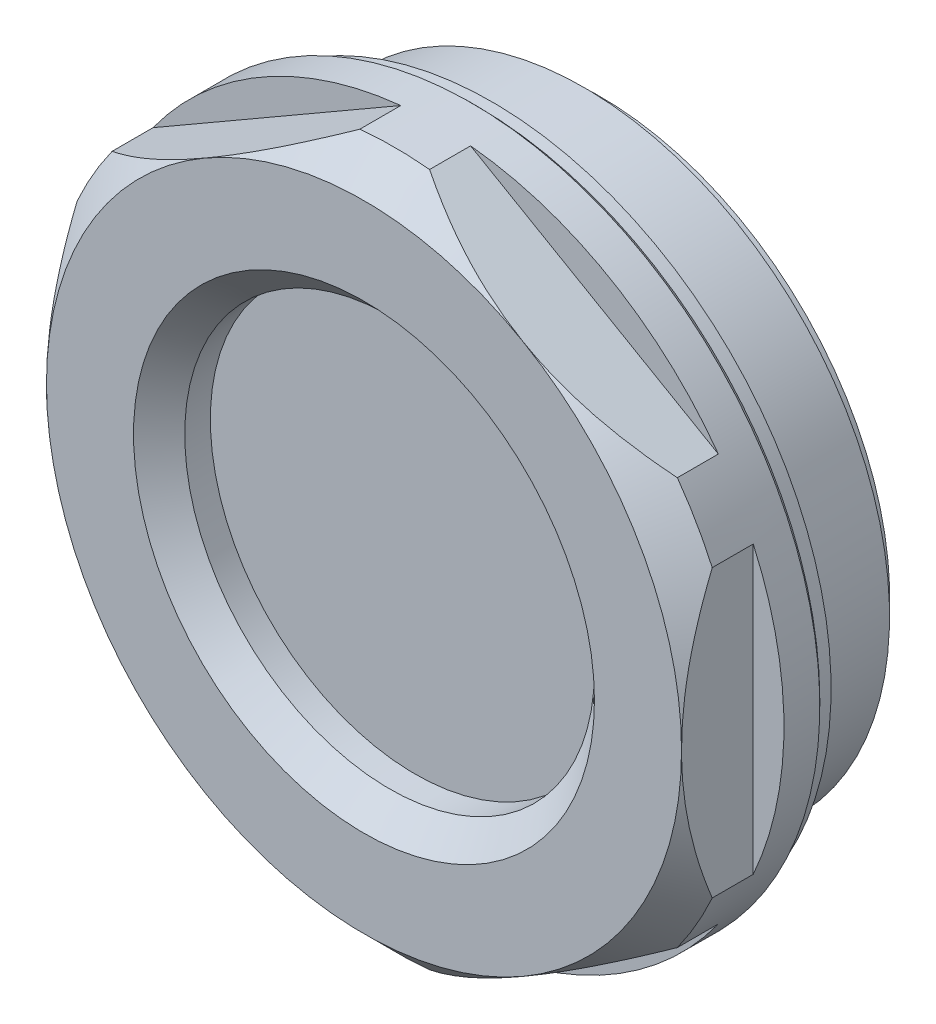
ISO-10303-21;
HEADER;
FILE_DESCRIPTION(('STEP AP214'),'2;1');
FILE_NAME('part.step','',(''),(''),'','','');
FILE_SCHEMA(('AUTOMOTIVE_DESIGN { 1 0 10303 214 1 1 1 1 }'));
ENDSEC;
DATA;
#1=APPLICATION_CONTEXT('core data for automotive mechanical design processes');
#2=APPLICATION_PROTOCOL_DEFINITION('international standard','automotive_design',2000,#1);
#3=PRODUCT_CONTEXT('',#1,'mechanical');
#4=PRODUCT('Part','Part','',(#3));
#5=PRODUCT_RELATED_PRODUCT_CATEGORY('part','',(#4));
#6=PRODUCT_DEFINITION_FORMATION('','',#4);
#7=PRODUCT_DEFINITION_CONTEXT('part definition',#1,'design');
#8=PRODUCT_DEFINITION('design','',#6,#7);
#9=PRODUCT_DEFINITION_SHAPE('','',#8);
#10=(LENGTH_UNIT() NAMED_UNIT(*) SI_UNIT(.MILLI.,.METRE.));
#11=(NAMED_UNIT(*) PLANE_ANGLE_UNIT() SI_UNIT($,.RADIAN.));
#12=(NAMED_UNIT(*) SI_UNIT($,.STERADIAN.) SOLID_ANGLE_UNIT());
#13=UNCERTAINTY_MEASURE_WITH_UNIT(LENGTH_MEASURE(1.E-05),#10,'distance_accuracy_value','');
#14=(GEOMETRIC_REPRESENTATION_CONTEXT(3) GLOBAL_UNCERTAINTY_ASSIGNED_CONTEXT((#13)) GLOBAL_UNIT_ASSIGNED_CONTEXT((#10,
#11,#12)) REPRESENTATION_CONTEXT('',''));
#15=CARTESIAN_POINT('',(0.,0.,0.));
#16=DIRECTION('',(0.,0.,1.));
#17=DIRECTION('',(1.,0.,0.));
#18=AXIS2_PLACEMENT_3D('',#15,#16,#17);
#19=CARTESIAN_POINT('',(-2.42210765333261E-11,1.2490009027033E-11,12.5));
#20=DIRECTION('',(1.93768612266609E-12,-9.9920072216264E-13,-1.));
#21=DIRECTION('',(-1.,0.,-1.93768612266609E-12));
#22=AXIS2_PLACEMENT_3D('',#19,#20,#21);
#23=CONICAL_SURFACE('',#22,31.,0.78539816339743);
#24=CARTESIAN_POINT('',(-1.84080181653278E-11,9.49240686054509E-12,9.5));
#25=DIRECTION('',(1.93768612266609E-12,-9.9920072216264E-13,-1.));
#26=DIRECTION('',(-1.,0.,-1.93768612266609E-12));
#27=AXIS2_PLACEMENT_3D('',#24,#25,#26);
#28=CIRCLE('',#27,34.);
#29=CARTESIAN_POINT('',(27.5933866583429,19.8646674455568,9.50000000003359));
#30=VERTEX_POINT('',#29);
#31=CARTESIAN_POINT('',(30.9999999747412,13.9642400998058,9.50000000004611));
#32=VERTEX_POINT('',#31);
#33=EDGE_CURVE('E168',#30,#32,#28,.T.);
#34=ORIENTED_EDGE('',*,*,#33,.F.);
#35=CARTESIAN_POINT('',(27.5935866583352,19.8645519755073,9.49990514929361));
#36=CARTESIAN_POINT('',(27.1443084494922,20.1239428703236,9.71297001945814));
#37=CARTESIAN_POINT('',(26.6919736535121,20.3850984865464,9.91763114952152));
#38=CARTESIAN_POINT('',(25.7810907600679,20.9109969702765,10.3081972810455));
#39=CARTESIAN_POINT('',(25.3225404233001,21.1757411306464,10.4940953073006));
#40=CARTESIAN_POINT('',(24.3981320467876,21.709448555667,10.8455303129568));
#41=CARTESIAN_POINT('',(23.9322567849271,21.9784217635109,11.0110072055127));
#42=CARTESIAN_POINT('',(22.9948214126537,22.5196503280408,11.3188367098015));
#43=CARTESIAN_POINT('',(22.5232616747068,22.7919054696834,11.4611908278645));
#44=CARTESIAN_POINT('',(21.5794157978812,23.3368351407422,11.7194794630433));
#45=CARTESIAN_POINT('',(21.107178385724,23.6094815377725,11.8356503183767));
#46=CARTESIAN_POINT('',(20.1583442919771,24.1572911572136,12.041390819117));
#47=CARTESIAN_POINT('',(19.6817475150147,24.4324544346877,12.1309598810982));
#48=CARTESIAN_POINT('',(18.7257710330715,24.9843877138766,12.2818068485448));
#49=CARTESIAN_POINT('',(18.2463953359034,25.2611554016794,12.343118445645));
#50=CARTESIAN_POINT('',(17.2855070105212,25.8159245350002,12.436433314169));
#51=CARTESIAN_POINT('',(16.8039944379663,26.0939259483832,12.4684373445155));
#52=CARTESIAN_POINT('',(15.8633600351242,26.6370014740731,12.5016824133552));
#53=CARTESIAN_POINT('',(15.4042752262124,26.9020542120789,12.5043290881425));
#54=CARTESIAN_POINT('',(14.4865957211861,27.4318767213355,12.4824447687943));
#55=CARTESIAN_POINT('',(14.0280010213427,27.6966464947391,12.4579139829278));
#56=CARTESIAN_POINT('',(13.1122679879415,28.2253452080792,12.3821040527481));
#57=CARTESIAN_POINT('',(12.6551304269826,28.4892737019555,12.3308125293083));
#58=CARTESIAN_POINT('',(11.743601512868,29.0155451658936,12.2023777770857));
#59=CARTESIAN_POINT('',(11.2892101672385,29.2778881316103,12.1252344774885));
#60=CARTESIAN_POINT('',(10.3843850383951,29.8002891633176,11.946427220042));
#61=CARTESIAN_POINT('',(9.93394879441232,30.0603486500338,11.844779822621));
#62=CARTESIAN_POINT('',(9.0374124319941,30.5779641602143,11.6184786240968));
#63=CARTESIAN_POINT('',(8.59131295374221,30.8355198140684,11.4938214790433));
#64=CARTESIAN_POINT('',(7.26076935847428,31.6037095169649,11.0879908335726));
#65=CARTESIAN_POINT('',(6.38349888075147,32.1102018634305,10.7748393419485));
#66=CARTESIAN_POINT('',(5.16145346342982,32.8157501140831,10.2830562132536));
#67=CARTESIAN_POINT('',(4.80744609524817,33.0201363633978,10.1338611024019));
#68=CARTESIAN_POINT('',(4.10384947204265,33.4263580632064,9.82475012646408));
#69=CARTESIAN_POINT('',(3.75425219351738,33.628198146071,9.66485863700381));
#70=CARTESIAN_POINT('',(3.40641331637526,33.8290230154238,9.49990514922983));
#71=B_SPLINE_CURVE_WITH_KNOTS('',3,(#35,#36,#37,#38,#39,#40,#41,#42,#43,#44,#45,#46,#47,#48,#49,
#50,#51,#52,#53,#54,#55,#56,#57,#58,#59,#60,#61,#62,#63,#64,#65,#66,#67,#68,#69,#70),
.UNSPECIFIED.,.F.,.F.,(4,2,2,2,2,2,2,2,2,2,2,2,2,2,2,2,2,4),(0.,1.68252577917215,
3.36567475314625,5.05366374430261,6.74154272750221,8.4135149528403,10.0855238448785,
11.7555339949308,13.4255008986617,15.0151435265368,16.6047739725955,18.1951404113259,
19.7855112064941,21.3748101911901,22.9643403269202,26.1413624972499,27.4467134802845,
28.7491849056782),.UNSPECIFIED.);
#72=CARTESIAN_POINT('',(15.4999999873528,26.8467874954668,12.5000000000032));
#73=VERTEX_POINT('',#72);
#74=EDGE_CURVE('E211',#30,#73,#71,.T.);
#75=ORIENTED_EDGE('',*,*,#74,.T.);
#76=CARTESIAN_POINT('',(-2.42210765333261E-11,1.2490009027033E-11,12.5));
#77=DIRECTION('',(1.93768612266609E-12,-9.9920072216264E-13,-1.));
#78=DIRECTION('',(-1.,0.,-1.93768612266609E-12));
#79=AXIS2_PLACEMENT_3D('',#76,#77,#78);
#80=CIRCLE('',#79,31.);
#81=CARTESIAN_POINT('',(30.9999999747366,1.2490009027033E-11,12.50000000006));
#82=VERTEX_POINT('',#81);
#83=EDGE_CURVE('E154',#73,#82,#80,.T.);
#84=ORIENTED_EDGE('',*,*,#83,.T.);
#85=CARTESIAN_POINT('',(30.9999999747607,-30.4256641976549,0.0635977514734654));
#86=CARTESIAN_POINT('',(30.9999999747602,-30.0453435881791,0.32999414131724));
#87=CARTESIAN_POINT('',(30.9999999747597,-29.6638331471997,0.594689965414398));
#88=CARTESIAN_POINT('',(30.9999999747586,-28.8982601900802,1.12038305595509));
#89=CARTESIAN_POINT('',(30.9999999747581,-28.514197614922,1.38138023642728));
#90=CARTESIAN_POINT('',(30.9999999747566,-27.3577399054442,2.15850013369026));
#91=CARTESIAN_POINT('',(30.9999999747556,-26.5812815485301,2.6686059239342));
#92=CARTESIAN_POINT('',(30.9999999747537,-25.0103959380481,3.67346725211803));
#93=CARTESIAN_POINT('',(30.9999999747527,-24.2158784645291,4.16808207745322));
#94=CARTESIAN_POINT('',(30.9999999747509,-22.6129398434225,5.13418167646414));
#95=CARTESIAN_POINT('',(30.9999999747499,-21.804519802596,5.60566827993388));
#96=CARTESIAN_POINT('',(30.9999999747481,-20.143102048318,6.5371183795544));
#97=CARTESIAN_POINT('',(30.9999999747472,-19.289540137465,6.99608037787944));
#98=CARTESIAN_POINT('',(30.9999999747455,-17.5637150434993,7.87790204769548));
#99=CARTESIAN_POINT('',(30.9999999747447,-16.691449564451,8.30075725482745));
#100=CARTESIAN_POINT('',(30.9999999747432,-14.9294093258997,9.10126356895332));
#101=CARTESIAN_POINT('',(30.9999999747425,-14.0396938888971,9.47904449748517));
#102=CARTESIAN_POINT('',(30.9999999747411,-12.239609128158,10.181503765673));
#103=CARTESIAN_POINT('',(30.9999999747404,-11.3292477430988,10.5062021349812));
#104=CARTESIAN_POINT('',(30.9999999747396,-10.0218115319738,10.9223692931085));
#105=CARTESIAN_POINT('',(30.9999999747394,-9.63295989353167,11.0399662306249));
#106=CARTESIAN_POINT('',(30.999999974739,-8.85184645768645,11.263140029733));
#107=CARTESIAN_POINT('',(30.9999999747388,-8.4595850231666,11.368718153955));
#108=CARTESIAN_POINT('',(30.9999999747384,-7.67179270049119,11.5670848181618));
#109=CARTESIAN_POINT('',(30.9999999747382,-7.27626146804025,11.6598719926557));
#110=CARTESIAN_POINT('',(30.9999999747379,-6.48216317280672,11.8319061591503));
#111=CARTESIAN_POINT('',(30.9999999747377,-6.0835954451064,11.9111500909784));
#112=CARTESIAN_POINT('',(30.9999999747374,-5.28844926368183,12.0545467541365));
#113=CARTESIAN_POINT('',(30.9999999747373,-4.89190010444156,12.1188615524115));
#114=CARTESIAN_POINT('',(30.9999999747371,-4.09671739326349,12.2329522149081));
#115=CARTESIAN_POINT('',(30.999999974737,-3.69808387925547,12.2827283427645));
#116=CARTESIAN_POINT('',(30.9999999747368,-2.89921995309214,12.3672563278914));
#117=CARTESIAN_POINT('',(30.9999999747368,-2.49898953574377,12.4020081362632));
#118=CARTESIAN_POINT('',(30.9999999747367,-1.69752262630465,12.4561323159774));
#119=CARTESIAN_POINT('',(30.9999999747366,-1.29628621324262,12.4755058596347));
#120=CARTESIAN_POINT('',(30.9999999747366,-0.408890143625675,12.5011072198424));
#121=CARTESIAN_POINT('',(30.9999999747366,0.0773786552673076,12.5037123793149));
#122=CARTESIAN_POINT('',(30.9999999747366,1.04941418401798,12.486049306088));
#123=CARTESIAN_POINT('',(30.9999999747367,1.53518098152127,12.4657847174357));
#124=CARTESIAN_POINT('',(30.9999999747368,2.50535765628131,12.4026939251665));
#125=CARTESIAN_POINT('',(30.9999999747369,2.98976718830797,12.3598624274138));
#126=CARTESIAN_POINT('',(30.9999999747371,3.9561555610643,12.2522714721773));
#127=CARTESIAN_POINT('',(30.9999999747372,4.43813428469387,12.1875109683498));
#128=CARTESIAN_POINT('',(30.9999999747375,5.40542594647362,12.0359358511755));
#129=CARTESIAN_POINT('',(30.9999999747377,5.89069301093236,11.9488290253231));
#130=CARTESIAN_POINT('',(30.999999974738,6.8571346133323,11.7541955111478));
#131=CARTESIAN_POINT('',(30.9999999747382,7.33830867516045,11.6466664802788));
#132=CARTESIAN_POINT('',(30.9999999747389,8.77453147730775,11.2954770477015));
#133=CARTESIAN_POINT('',(30.9999999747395,9.72266714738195,11.0231519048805));
#134=CARTESIAN_POINT('',(30.9999999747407,11.6215167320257,10.4057142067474));
#135=CARTESIAN_POINT('',(30.9999999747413,12.5716710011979,10.0589113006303));
#136=CARTESIAN_POINT('',(30.9999999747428,14.4495765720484,9.30864224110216));
#137=CARTESIAN_POINT('',(30.9999999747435,15.3773188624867,8.90515372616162));
#138=CARTESIAN_POINT('',(30.9999999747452,17.2138686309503,8.05067814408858));
#139=CARTESIAN_POINT('',(30.9999999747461,18.1226110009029,7.59955229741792));
#140=CARTESIAN_POINT('',(30.9999999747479,19.9200587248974,6.65950521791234));
#141=CARTESIAN_POINT('',(30.9999999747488,20.8087666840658,6.17058893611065));
#142=CARTESIAN_POINT('',(30.9999999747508,22.5345059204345,5.18128821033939));
#143=CARTESIAN_POINT('',(30.9999999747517,23.3722093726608,4.68207025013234));
#144=CARTESIAN_POINT('',(30.9999999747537,25.0330958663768,3.65997675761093));
#145=CARTESIAN_POINT('',(30.9999999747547,25.8562777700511,3.13709938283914));
#146=CARTESIAN_POINT('',(30.9999999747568,27.4835707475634,2.07574141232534));
#147=CARTESIAN_POINT('',(30.9999999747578,28.2877793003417,1.53740991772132));
#148=CARTESIAN_POINT('',(30.9999999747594,29.4856066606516,0.717802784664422));
#149=CARTESIAN_POINT('',(30.9999999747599,29.8834147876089,0.442620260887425));
#150=CARTESIAN_POINT('',(30.999999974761,30.6764058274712,-0.111483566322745));
#151=CARTESIAN_POINT('',(30.9999999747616,31.0715887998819,-0.390404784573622));
#152=CARTESIAN_POINT('',(30.9999999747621,31.4655510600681,-0.67104144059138));
#153=B_SPLINE_CURVE_WITH_KNOTS('',3,(#85,#86,#87,#88,#89,#90,#91,#92,#93,#94,#95,#96,#97,#98,
#99,#100,#101,#102,#103,#104,#105,#106,#107,#108,#109,#110,#111,#112,#113,#114,#115,#116,#117,
#118,#119,#120,#121,#122,#123,#124,#125,#126,#127,#128,#129,#130,#131,#132,#133,#134,#135,#136,
#137,#138,#139,#140,#141,#142,#143,#144,#145,#146,#147,#148,#149,#150,#151,#152),.UNSPECIFIED.,
.F.,.F.,(4,2,2,2,2,2,2,2,2,2,2,2,2,2,2,2,2,2,2,2,2,2,2,2,2,2,2,2,2,2,2,2,2,4),(0.,
1.39300862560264,2.78604957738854,5.57288944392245,8.38025294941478,11.1873939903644,
14.0940784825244,17.0011218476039,19.8995792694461,22.7969404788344,24.0155217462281,
25.2339748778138,26.4525579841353,27.671416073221,28.8763492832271,30.0812606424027,
31.2861759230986,32.4909993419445,33.9492703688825,35.4073090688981,36.8656899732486,
38.3241404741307,39.8027318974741,41.2814930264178,44.237844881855,47.2701539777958,
50.3036626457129,53.3462661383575,56.3884716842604,59.3135360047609,62.2388285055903,
65.1418496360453,66.5929663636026,68.0440500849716),.UNSPECIFIED.);
#154=EDGE_CURVE('E221',#82,#32,#153,.T.);
#155=ORIENTED_EDGE('',*,*,#154,.T.);
#156=EDGE_LOOP('',(#34,#75,#84,#155));
#157=FACE_BOUND('',#156,.T.);
#158=ADVANCED_FACE('F14',(#157),#23,.T.);
#159=CARTESIAN_POINT('',(30.9999999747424,-13.9642400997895,9.500000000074));
#160=VERTEX_POINT('',#159);
#161=CARTESIAN_POINT('',(27.5933866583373,-19.8646674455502,9.50000000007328));
#162=VERTEX_POINT('',#161);
#163=EDGE_CURVE('E176',#160,#162,#28,.T.);
#164=ORIENTED_EDGE('',*,*,#163,.F.);
#165=EDGE_CURVE('E220',#160,#82,#153,.T.);
#166=ORIENTED_EDGE('',*,*,#165,.T.);
#167=CARTESIAN_POINT('',(15.4999999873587,-26.8467874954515,12.5000000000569));
#168=VERTEX_POINT('',#167);
#169=EDGE_CURVE('E163',#82,#168,#80,.T.);
#170=ORIENTED_EDGE('',*,*,#169,.T.);
#171=CARTESIAN_POINT('',(3.40641331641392,-33.8290230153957,9.49990514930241));
#172=CARTESIAN_POINT('',(3.8556915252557,-33.5696321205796,9.71297001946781));
#173=CARTESIAN_POINT('',(4.30802632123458,-33.3084765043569,9.9176311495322));
#174=CARTESIAN_POINT('',(5.21890921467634,-32.7825780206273,10.3081972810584));
#175=CARTESIAN_POINT('',(5.67745955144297,-32.5178338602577,10.4940953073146));
#176=CARTESIAN_POINT('',(6.60186792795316,-31.9841264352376,10.8455303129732));
#177=CARTESIAN_POINT('',(7.06774318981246,-31.715153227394,11.0110072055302));
#178=CARTESIAN_POINT('',(8.00517856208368,-31.1739246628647,11.3188367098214));
#179=CARTESIAN_POINT('',(8.47673830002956,-30.9016695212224,11.4611908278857));
#180=CARTESIAN_POINT('',(9.42058417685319,-30.3567398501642,11.719479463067));
#181=CARTESIAN_POINT('',(9.89282158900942,-30.0840934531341,11.8356503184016));
#182=CARTESIAN_POINT('',(10.8416556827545,-29.5362838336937,12.0413908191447));
#183=CARTESIAN_POINT('',(11.318252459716,-29.2611205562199,12.1309598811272));
#184=CARTESIAN_POINT('',(12.2742289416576,-28.7091872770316,12.2818068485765));
#185=CARTESIAN_POINT('',(12.7536046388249,-28.432419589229,12.3431184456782));
#186=CARTESIAN_POINT('',(13.7144929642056,-27.8776504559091,12.4364333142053));
#187=CARTESIAN_POINT('',(14.19600553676,-27.5996490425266,12.4684373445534));
#188=CARTESIAN_POINT('',(15.136639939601,-27.0565735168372,12.5016824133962));
#189=CARTESIAN_POINT('',(15.5957247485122,-26.7915207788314,12.5043290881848));
#190=CARTESIAN_POINT('',(16.5134042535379,-26.2616982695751,12.4824447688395));
#191=CARTESIAN_POINT('',(16.9719989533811,-25.9969284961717,12.4579139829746));
#192=CARTESIAN_POINT('',(17.8877319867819,-25.4682297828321,12.3821040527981));
#193=CARTESIAN_POINT('',(18.3448695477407,-25.2043012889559,12.3308125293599));
#194=CARTESIAN_POINT('',(19.256398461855,-24.6780298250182,12.2023777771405));
#195=CARTESIAN_POINT('',(19.7107898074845,-24.4156868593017,12.125234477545));
#196=CARTESIAN_POINT('',(20.615614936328,-23.8932858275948,11.9464272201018));
#197=CARTESIAN_POINT('',(21.0660511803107,-23.6332263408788,11.8447798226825));
#198=CARTESIAN_POINT('',(21.9625875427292,-23.1156108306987,11.6184786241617));
#199=CARTESIAN_POINT('',(22.4086870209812,-22.8580551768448,11.49382147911));
#200=CARTESIAN_POINT('',(23.7392306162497,-22.0898654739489,11.0879908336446));
#201=CARTESIAN_POINT('',(24.6165010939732,-21.5833731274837,10.7748393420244));
#202=CARTESIAN_POINT('',(25.8385465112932,-20.8778248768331,10.2830562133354));
#203=CARTESIAN_POINT('',(26.1925538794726,-20.67343862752,10.133861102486));
#204=CARTESIAN_POINT('',(26.8961505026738,-20.2672169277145,9.8247501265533));
#205=CARTESIAN_POINT('',(27.2457477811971,-20.0653768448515,9.66485863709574));
#206=CARTESIAN_POINT('',(27.5935866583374,-19.8645519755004,9.49990514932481));
#207=B_SPLINE_CURVE_WITH_KNOTS('',3,(#171,#172,#173,#174,#175,#176,#177,#178,#179,#180,#181,
#182,#183,#184,#185,#186,#187,#188,#189,#190,#191,#192,#193,#194,#195,#196,#197,#198,#199,#200,
#201,#202,#203,#204,#205,#206),.UNSPECIFIED.,.F.,.F.,(4,2,2,2,2,2,2,2,2,2,2,2,2,2,2,2,2,4),(0.,
1.68252577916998,3.36567475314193,5.05366374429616,6.74154272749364,8.41351495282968,
10.0855238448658,11.7555339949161,13.425500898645,15.0151435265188,16.6047739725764,
18.1951404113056,19.7855112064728,21.3748101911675,22.9643403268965,26.1413624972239,
27.4467134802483,28.7491849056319),.UNSPECIFIED.);
#208=EDGE_CURVE('E322',#168,#162,#207,.T.);
#209=ORIENTED_EDGE('',*,*,#208,.T.);
#210=EDGE_LOOP('',(#164,#166,#170,#209));
#211=FACE_BOUND('',#210,.T.);
#212=ADVANCED_FACE('F295',(#211),#23,.T.);
#213=CARTESIAN_POINT('',(3.40661331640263,-33.8289075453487,9.50000000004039));
#214=VERTEX_POINT('',#213);
#215=CARTESIAN_POINT('',(-3.40661331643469,-33.8289075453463,9.50000000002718));
#216=VERTEX_POINT('',#215);
#217=EDGE_CURVE('E171',#214,#216,#28,.T.);
#218=ORIENTED_EDGE('',*,*,#217,.F.);
#219=EDGE_CURVE('E38',#214,#168,#207,.T.);
#220=ORIENTED_EDGE('',*,*,#219,.T.);
#221=CARTESIAN_POINT('',(-15.4999999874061,-26.8467874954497,12.4999999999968));
#222=VERTEX_POINT('',#221);
#223=EDGE_CURVE('E157',#168,#222,#80,.T.);
#224=ORIENTED_EDGE('',*,*,#223,.T.);
#225=CARTESIAN_POINT('',(-27.5935866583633,-19.8645519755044,9.49990514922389));
#226=CARTESIAN_POINT('',(-27.1443084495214,-20.1239428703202,9.71297001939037));
#227=CARTESIAN_POINT('',(-26.6919736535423,-20.3850984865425,9.91763114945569));
#228=CARTESIAN_POINT('',(-25.7810907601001,-20.9109969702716,10.3081972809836));
#229=CARTESIAN_POINT('',(-25.3225404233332,-21.1757411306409,10.4940953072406));
#230=CARTESIAN_POINT('',(-24.3981320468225,-21.7094485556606,10.8455303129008));
#231=CARTESIAN_POINT('',(-23.932256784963,-21.978421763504,11.0110072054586));
#232=CARTESIAN_POINT('',(-22.9948214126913,-22.5196503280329,11.3188367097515));
#233=CARTESIAN_POINT('',(-22.5232616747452,-22.7919054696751,11.4611908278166));
#234=CARTESIAN_POINT('',(-21.579415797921,-23.3368351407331,11.7194794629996));
#235=CARTESIAN_POINT('',(-21.1071783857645,-23.6094815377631,11.835650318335));
#236=CARTESIAN_POINT('',(-20.1583442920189,-24.1572911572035,12.0413908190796));
#237=CARTESIAN_POINT('',(-19.6817475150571,-24.4324544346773,12.1309598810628));
#238=CARTESIAN_POINT('',(-18.7257710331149,-24.9843877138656,12.2818068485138));
#239=CARTESIAN_POINT('',(-18.2463953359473,-25.2611554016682,12.3431184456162));
#240=CARTESIAN_POINT('',(-17.285507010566,-25.8159245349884,12.4364333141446));
#241=CARTESIAN_POINT('',(-16.8039944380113,-26.0939259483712,12.4684373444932));
#242=CARTESIAN_POINT('',(-15.8633600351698,-26.6370014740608,12.5016824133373));
#243=CARTESIAN_POINT('',(-15.4042752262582,-26.9020542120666,12.5043290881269));
#244=CARTESIAN_POINT('',(-14.4865957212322,-27.4318767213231,12.4824447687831));
#245=CARTESIAN_POINT('',(-14.0280010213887,-27.6966464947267,12.4579139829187));
#246=CARTESIAN_POINT('',(-13.1122679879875,-28.2253452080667,12.3821040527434));
#247=CARTESIAN_POINT('',(-12.6551304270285,-28.489273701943,12.3308125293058));
#248=CARTESIAN_POINT('',(-11.7436015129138,-29.0155451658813,12.2023777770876));
#249=CARTESIAN_POINT('',(-11.2892101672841,-29.277888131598,12.1252344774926));
#250=CARTESIAN_POINT('',(-10.3843850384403,-29.8002891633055,11.9464272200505));
#251=CARTESIAN_POINT('',(-9.9339487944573,-30.0603486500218,11.8447798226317));
#252=CARTESIAN_POINT('',(-9.03741243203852,-30.5779641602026,11.618478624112));
#253=CARTESIAN_POINT('',(-8.59131295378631,-30.8355198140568,11.4938214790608));
#254=CARTESIAN_POINT('',(-7.26076935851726,-31.6037095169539,11.0879908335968));
#255=CARTESIAN_POINT('',(-6.38349888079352,-32.11020186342,10.7748393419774));
#256=CARTESIAN_POINT('',(-5.16145346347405,-32.8157501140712,10.2830562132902));
#257=CARTESIAN_POINT('',(-4.80744609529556,-33.0201363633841,10.1338611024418));
#258=CARTESIAN_POINT('',(-4.10384947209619,-33.426358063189,9.82475012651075));
#259=CARTESIAN_POINT('',(-3.75425219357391,-33.6281981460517,9.66485863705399));
#260=CARTESIAN_POINT('',(-3.4064133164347,-33.8290230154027,9.4999051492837));
#261=B_SPLINE_CURVE_WITH_KNOTS('',3,(#225,#226,#227,#228,#229,#230,#231,#232,#233,#234,#235,
#236,#237,#238,#239,#240,#241,#242,#243,#244,#245,#246,#247,#248,#249,#250,#251,#252,#253,#254,
#255,#256,#257,#258,#259,#260),.UNSPECIFIED.,.F.,.F.,(4,2,2,2,2,2,2,2,2,2,2,2,2,2,2,2,2,4),(0.,
1.68252577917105,3.36567475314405,5.0536637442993,6.74154272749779,8.41351495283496,
10.0855238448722,11.7555339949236,13.4255008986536,15.0151435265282,16.6047739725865,
18.1951404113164,19.7855112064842,21.3748101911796,22.9643403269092,26.1413624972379,
27.4467134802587,28.7491849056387),.UNSPECIFIED.);
#262=EDGE_CURVE('E323',#222,#216,#261,.T.);
#263=ORIENTED_EDGE('',*,*,#262,.T.);
#264=EDGE_LOOP('',(#218,#220,#224,#263));
#265=FACE_BOUND('',#264,.T.);
#266=ADVANCED_FACE('F301',(#265),#23,.T.);
#267=CARTESIAN_POINT('',(-27.593386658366,-19.8646674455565,9.49999999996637));
#268=VERTEX_POINT('',#267);
#269=CARTESIAN_POINT('',(-30.9999999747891,-13.9642400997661,9.49999999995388));
#270=VERTEX_POINT('',#269);
#271=EDGE_CURVE('E165',#268,#270,#28,.T.);
#272=ORIENTED_EDGE('',*,*,#271,.F.);
#273=EDGE_CURVE('E30',#268,#222,#261,.T.);
#274=ORIENTED_EDGE('',*,*,#273,.T.);
#275=CARTESIAN_POINT('',(-30.9999999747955,1.2490009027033E-11,12.4999999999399));
#276=VERTEX_POINT('',#275);
#277=EDGE_CURVE('E148',#222,#276,#80,.T.);
#278=ORIENTED_EDGE('',*,*,#277,.T.);
#279=CARTESIAN_POINT('',(-30.9999999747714,-30.4256641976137,0.0635977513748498));
#280=CARTESIAN_POINT('',(-30.9999999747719,-30.0453435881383,0.329994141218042));
#281=CARTESIAN_POINT('',(-30.9999999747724,-29.6638331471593,0.594689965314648));
#282=CARTESIAN_POINT('',(-30.9999999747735,-28.8982601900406,1.12038305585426));
#283=CARTESIAN_POINT('',(-30.999999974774,-28.5141976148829,1.38138023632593));
#284=CARTESIAN_POINT('',(-30.9999999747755,-27.3577399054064,2.15850013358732));
#285=CARTESIAN_POINT('',(-30.9999999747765,-26.5812815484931,2.66860592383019));
#286=CARTESIAN_POINT('',(-30.9999999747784,-25.0103959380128,3.67346725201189));
#287=CARTESIAN_POINT('',(-30.9999999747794,-24.2158784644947,4.168082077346));
#288=CARTESIAN_POINT('',(-30.9999999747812,-22.6129398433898,5.13418167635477));
#289=CARTESIAN_POINT('',(-30.9999999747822,-21.8045198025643,5.60566827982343));
#290=CARTESIAN_POINT('',(-30.999999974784,-20.1431020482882,6.53711837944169));
#291=CARTESIAN_POINT('',(-30.9999999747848,-19.2895401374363,6.99608037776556));
#292=CARTESIAN_POINT('',(-30.9999999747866,-17.5637150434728,7.8779020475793));
#293=CARTESIAN_POINT('',(-30.9999999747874,-16.6914495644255,8.30075725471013));
#294=CARTESIAN_POINT('',(-30.9999999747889,-14.9294093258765,9.10126356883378));
#295=CARTESIAN_POINT('',(-30.9999999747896,-14.0396938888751,9.47904449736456));
#296=CARTESIAN_POINT('',(-30.999999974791,-12.2396091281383,10.1815037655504));
#297=CARTESIAN_POINT('',(-30.9999999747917,-11.3292477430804,10.5062021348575));
#298=CARTESIAN_POINT('',(-30.9999999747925,-10.0218115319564,10.9223692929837));
#299=CARTESIAN_POINT('',(-30.9999999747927,-9.63295989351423,11.0399662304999));
#300=CARTESIAN_POINT('',(-30.9999999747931,-8.85184645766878,11.2631400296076));
#301=CARTESIAN_POINT('',(-30.9999999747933,-8.45958502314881,11.3687181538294));
#302=CARTESIAN_POINT('',(-30.9999999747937,-7.67179270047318,11.5670848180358));
#303=CARTESIAN_POINT('',(-30.9999999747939,-7.27626146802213,11.6598719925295));
#304=CARTESIAN_POINT('',(-30.9999999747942,-6.48216317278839,11.8319061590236));
#305=CARTESIAN_POINT('',(-30.9999999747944,-6.08359544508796,11.9111500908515));
#306=CARTESIAN_POINT('',(-30.9999999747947,-5.28844926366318,12.0545467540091));
#307=CARTESIAN_POINT('',(-30.9999999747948,-4.89190010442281,12.1188615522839));
#308=CARTESIAN_POINT('',(-30.999999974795,-4.09671739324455,12.23295221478));
#309=CARTESIAN_POINT('',(-30.9999999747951,-3.69808387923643,12.2827283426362));
#310=CARTESIAN_POINT('',(-30.9999999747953,-2.89921995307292,12.3672563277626));
#311=CARTESIAN_POINT('',(-30.9999999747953,-2.49898953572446,12.4020081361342));
#312=CARTESIAN_POINT('',(-30.9999999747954,-1.69752262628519,12.4561323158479));
#313=CARTESIAN_POINT('',(-30.9999999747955,-1.29628621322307,12.4755058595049));
#314=CARTESIAN_POINT('',(-30.9999999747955,-0.408890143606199,12.5011072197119));
#315=CARTESIAN_POINT('',(-30.9999999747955,0.0773786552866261,12.5037123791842));
#316=CARTESIAN_POINT('',(-30.9999999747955,1.04941418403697,12.4860493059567));
#317=CARTESIAN_POINT('',(-30.9999999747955,1.53518098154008,12.4657847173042));
#318=CARTESIAN_POINT('',(-30.9999999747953,2.50535765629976,12.4026939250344));
#319=CARTESIAN_POINT('',(-30.9999999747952,2.98976718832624,12.3598624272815));
#320=CARTESIAN_POINT('',(-30.999999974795,3.95615556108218,12.2522714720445));
#321=CARTESIAN_POINT('',(-30.9999999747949,4.43813428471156,12.1875109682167));
#322=CARTESIAN_POINT('',(-30.9999999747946,5.40542594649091,12.035935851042));
#323=CARTESIAN_POINT('',(-30.9999999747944,5.89069301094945,11.9488290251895));
#324=CARTESIAN_POINT('',(-30.9999999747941,6.85713461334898,11.7541955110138));
#325=CARTESIAN_POINT('',(-30.9999999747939,7.33830867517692,11.6466664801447));
#326=CARTESIAN_POINT('',(-30.9999999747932,8.77453147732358,11.2954770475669));
#327=CARTESIAN_POINT('',(-30.9999999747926,9.72266714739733,11.0231519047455));
#328=CARTESIAN_POINT('',(-30.9999999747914,11.6215167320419,10.4057142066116));
#329=CARTESIAN_POINT('',(-30.9999999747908,12.5716710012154,10.0589113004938));
#330=CARTESIAN_POINT('',(-30.9999999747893,14.4495765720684,9.30864224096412));
#331=CARTESIAN_POINT('',(-30.9999999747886,15.3773188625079,8.90515372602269));
#332=CARTESIAN_POINT('',(-30.9999999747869,17.2138686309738,8.05067814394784));
#333=CARTESIAN_POINT('',(-30.999999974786,18.1226110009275,7.59955229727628));
#334=CARTESIAN_POINT('',(-30.9999999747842,19.9200587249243,6.65950521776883));
#335=CARTESIAN_POINT('',(-30.9999999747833,20.8087666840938,6.17058893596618));
#336=CARTESIAN_POINT('',(-30.9999999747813,22.5345059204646,5.18128821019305));
#337=CARTESIAN_POINT('',(-30.9999999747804,23.3722093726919,4.6820702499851));
#338=CARTESIAN_POINT('',(-30.9999999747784,25.0330958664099,3.65997675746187));
#339=CARTESIAN_POINT('',(-30.9999999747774,25.8562777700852,3.13709938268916));
#340=CARTESIAN_POINT('',(-30.9999999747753,27.4835707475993,2.07574141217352));
#341=CARTESIAN_POINT('',(-30.9999999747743,28.2877793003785,1.53740991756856));
#342=CARTESIAN_POINT('',(-30.9999999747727,29.4856066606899,0.717802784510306));
#343=CARTESIAN_POINT('',(-30.9999999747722,29.8834147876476,0.442620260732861));
#344=CARTESIAN_POINT('',(-30.9999999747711,30.6764058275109,-0.111483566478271));
#345=CARTESIAN_POINT('',(-30.9999999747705,31.0715887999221,-0.390404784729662));
#346=CARTESIAN_POINT('',(-30.99999997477,31.4655510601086,-0.671041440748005));
#347=B_SPLINE_CURVE_WITH_KNOTS('',3,(#279,#280,#281,#282,#283,#284,#285,#286,#287,#288,#289,
#290,#291,#292,#293,#294,#295,#296,#297,#298,#299,#300,#301,#302,#303,#304,#305,#306,#307,#308,
#309,#310,#311,#312,#313,#314,#315,#316,#317,#318,#319,#320,#321,#322,#323,#324,#325,#326,#327,
#328,#329,#330,#331,#332,#333,#334,#335,#336,#337,#338,#339,#340,#341,#342,#343,#344,#345,#346),
.UNSPECIFIED.,.F.,.F.,(4,2,2,2,2,2,2,2,2,2,2,2,2,2,2,2,2,2,2,2,2,2,2,2,2,2,2,2,2,2,2,2,2,4),(0.,
1.39300862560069,2.78604957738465,5.57288944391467,8.38025294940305,11.1873939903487,
14.0940784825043,17.0011218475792,19.899579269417,22.7969404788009,24.0155217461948,
25.2339748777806,26.4525579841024,27.6714160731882,28.8763492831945,30.0812606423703,
31.2861759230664,32.4909993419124,33.94927036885,35.4073090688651,36.8656899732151,
38.3241404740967,39.8027318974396,41.2814930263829,44.237844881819,47.2701539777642,
50.3036626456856,53.3462661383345,56.3884716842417,59.3135360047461,62.2388285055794,
65.1418496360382,66.5929663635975,68.0440500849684),.UNSPECIFIED.);
#348=EDGE_CURVE('E351',#276,#270,#347,.F.);
#349=ORIENTED_EDGE('',*,*,#348,.T.);
#350=EDGE_LOOP('',(#272,#274,#278,#349));
#351=FACE_BOUND('',#350,.T.);
#352=ADVANCED_FACE('F398',(#351),#23,.T.);
#353=CARTESIAN_POINT('',(-30.9999999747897,13.9642400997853,9.49999999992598));
#354=VERTEX_POINT('',#353);
#355=CARTESIAN_POINT('',(-27.5933866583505,19.8646674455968,9.49999999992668));
#356=VERTEX_POINT('',#355);
#357=EDGE_CURVE('E158',#354,#356,#28,.T.);
#358=ORIENTED_EDGE('',*,*,#357,.F.);
#359=EDGE_CURVE('E357',#354,#276,#347,.F.);
#360=ORIENTED_EDGE('',*,*,#359,.T.);
#361=CARTESIAN_POINT('',(-15.4999999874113,26.8467874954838,12.4999999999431));
#362=VERTEX_POINT('',#361);
#363=EDGE_CURVE('E144',#276,#362,#80,.T.);
#364=ORIENTED_EDGE('',*,*,#363,.T.);
#365=CARTESIAN_POINT('',(-3.40641331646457,33.8290230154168,9.49990514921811));
#366=CARTESIAN_POINT('',(-3.85569152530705,33.5696321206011,9.71297001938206));
#367=CARTESIAN_POINT('',(-4.3080263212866,33.308476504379,9.91763114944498));
#368=CARTESIAN_POINT('',(-5.21890921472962,32.7825780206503,10.3081972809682));
#369=CARTESIAN_POINT('',(-5.67745955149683,32.5178338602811,10.4940953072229));
#370=CARTESIAN_POINT('',(-6.60186792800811,31.9841264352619,10.8455303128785));
#371=CARTESIAN_POINT('',(-7.0677431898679,31.7151532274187,11.011007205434));
#372=CARTESIAN_POINT('',(-8.00517856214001,31.1739246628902,11.3188367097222));
#373=CARTESIAN_POINT('',(-8.47673830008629,30.9016695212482,11.461190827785));
#374=CARTESIAN_POINT('',(-9.42058417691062,30.3567398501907,11.7194794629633));
#375=CARTESIAN_POINT('',(-9.89282158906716,30.084093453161,11.8356503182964));
#376=CARTESIAN_POINT('',(-10.8416556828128,29.5362838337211,12.0413908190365));
#377=CARTESIAN_POINT('',(-11.3182524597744,29.2611205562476,12.1309598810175));
#378=CARTESIAN_POINT('',(-12.2742289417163,28.7091872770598,12.2818068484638));
#379=CARTESIAN_POINT('',(-12.7536046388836,28.4324195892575,12.343118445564));
#380=CARTESIAN_POINT('',(-13.7144929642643,27.8776504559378,12.4364333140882));
#381=CARTESIAN_POINT('',(-14.1960055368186,27.5996490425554,12.4684373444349));
#382=CARTESIAN_POINT('',(-15.1366399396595,27.0565735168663,12.5016824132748));
#383=CARTESIAN_POINT('',(-15.5957247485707,26.7915207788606,12.5043290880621));
#384=CARTESIAN_POINT('',(-16.5134042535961,26.2616982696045,12.4824447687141));
#385=CARTESIAN_POINT('',(-16.9719989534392,25.9969284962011,12.4579139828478));
#386=CARTESIAN_POINT('',(-17.8877319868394,25.4682297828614,12.3821040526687));
#387=CARTESIAN_POINT('',(-18.3448695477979,25.2043012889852,12.3308125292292));
#388=CARTESIAN_POINT('',(-19.2563984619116,24.6780298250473,12.2023777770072));
#389=CARTESIAN_POINT('',(-19.7107898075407,24.4156868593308,12.1252344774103));
#390=CARTESIAN_POINT('',(-20.6156149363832,23.8932858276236,11.9464272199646));
#391=CARTESIAN_POINT('',(-21.0660511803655,23.6332263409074,11.8447798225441));
#392=CARTESIAN_POINT('',(-21.9625875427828,23.115610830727,11.6184786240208));
#393=CARTESIAN_POINT('',(-22.4086870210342,22.858055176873,11.4938214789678));
#394=CARTESIAN_POINT('',(-23.7392306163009,22.0898654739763,11.0879908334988));
#395=CARTESIAN_POINT('',(-24.6165010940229,21.5833731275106,10.7748393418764));
#396=CARTESIAN_POINT('',(-25.8385465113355,20.8778248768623,10.2830562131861));
#397=CARTESIAN_POINT('',(-26.192553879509,20.6734386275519,10.1338611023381));
#398=CARTESIAN_POINT('',(-26.8961505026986,20.2672169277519,9.82475012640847));
#399=CARTESIAN_POINT('',(-27.245747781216,20.0653768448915,9.66485863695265));
#400=CARTESIAN_POINT('',(-27.5935866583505,19.8645519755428,9.4999051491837));
#401=B_SPLINE_CURVE_WITH_KNOTS('',3,(#365,#366,#367,#368,#369,#370,#371,#372,#373,#374,#375,
#376,#377,#378,#379,#380,#381,#382,#383,#384,#385,#386,#387,#388,#389,#390,#391,#392,#393,#394,
#395,#396,#397,#398,#399,#400),.UNSPECIFIED.,.F.,.F.,(4,2,2,2,2,2,2,2,2,2,2,2,2,2,2,2,2,4),(0.,
1.6825257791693,3.36567475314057,5.05366374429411,6.7415427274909,8.41351495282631,
10.0855238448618,11.7555339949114,13.4255008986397,15.0151435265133,16.6047739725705,
18.1951404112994,19.7855112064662,21.3748101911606,22.9643403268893,26.1413624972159,
27.4467134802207,28.7491849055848),.UNSPECIFIED.);
#402=EDGE_CURVE('E358',#362,#356,#401,.T.);
#403=ORIENTED_EDGE('',*,*,#402,.T.);
#404=EDGE_LOOP('',(#358,#360,#364,#403));
#405=FACE_BOUND('',#404,.T.);
#406=ADVANCED_FACE('F293',(#405),#23,.T.);
#407=CARTESIAN_POINT('',(-2.42210765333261E-11,31.0000000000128,12.499999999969));
#408=DIRECTION('',(-1.93768612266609E-12,9.9920072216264E-13,1.));
#409=DIRECTION('',(1.,0.,1.93768612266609E-12));
#410=AXIS2_PLACEMENT_3D('',#407,#408,#409);
#411=PLANE('',#410);
#412=CARTESIAN_POINT('',(-2.42210765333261E-11,1.2490009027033E-11,12.5));
#413=DIRECTION('',(-1.93768612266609E-12,9.9920072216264E-13,1.));
#414=DIRECTION('',(1.,0.,1.93768612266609E-12));
#415=AXIS2_PLACEMENT_3D('',#412,#413,#414);
#416=CIRCLE('',#415,22.5);
#417=CARTESIAN_POINT('',(22.4999999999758,1.24900090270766E-11,12.5000000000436));
#418=VERTEX_POINT('',#417);
#419=EDGE_CURVE('E208',#418,#418,#416,.T.);
#420=ORIENTED_EDGE('',*,*,#419,.F.);
#421=EDGE_LOOP('',(#420));
#422=FACE_BOUND('',#421,.T.);
#423=ORIENTED_EDGE('',*,*,#363,.F.);
#424=ORIENTED_EDGE('',*,*,#277,.F.);
#425=ORIENTED_EDGE('',*,*,#223,.F.);
#426=ORIENTED_EDGE('',*,*,#169,.F.);
#427=ORIENTED_EDGE('',*,*,#83,.F.);
#428=EDGE_CURVE('E147',#362,#73,#80,.T.);
#429=ORIENTED_EDGE('',*,*,#428,.F.);
#430=EDGE_LOOP('',(#423,#424,#425,#426,#427,#429));
#431=FACE_BOUND('',#430,.T.);
#432=ADVANCED_FACE('F16',(#422,#431),#411,.T.);
#433=ORIENTED_EDGE('',*,*,#428,.T.);
#434=CARTESIAN_POINT('',(3.40661331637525,33.8289075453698,9.49999999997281));
#435=VERTEX_POINT('',#434);
#436=EDGE_CURVE('E212',#73,#435,#71,.T.);
#437=ORIENTED_EDGE('',*,*,#436,.T.);
#438=CARTESIAN_POINT('',(-3.40661331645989,33.8289075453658,9.4999999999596));
#439=VERTEX_POINT('',#438);
#440=EDGE_CURVE('E164',#439,#435,#28,.T.);
#441=ORIENTED_EDGE('',*,*,#440,.F.);
#442=EDGE_CURVE('E127',#439,#362,#401,.T.);
#443=ORIENTED_EDGE('',*,*,#442,.T.);
#444=EDGE_LOOP('',(#433,#437,#441,#443));
#445=FACE_BOUND('',#444,.T.);
#446=ADVANCED_FACE('F228',(#445),#23,.T.);
#447=CARTESIAN_POINT('',(3.90580664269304E-11,-2.01505478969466E-11,-20.1570656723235));
#448=DIRECTION('',(1.93768612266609E-12,-9.9920072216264E-13,-1.));
#449=DIRECTION('',(-1.,0.,-1.93768612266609E-12));
#450=AXIS2_PLACEMENT_3D('',#447,#448,#449);
#451=CYLINDRICAL_SURFACE('',#450,34.);
#452=ORIENTED_EDGE('',*,*,#33,.T.);
#453=DIRECTION('',(-1.93768612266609E-12,9.9920072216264E-13,1.));
#454=VECTOR('',#453,1.);
#455=CARTESIAN_POINT('',(30.9999999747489,13.9642400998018,5.50000000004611));
#456=LINE('',#455,#454);
#457=CARTESIAN_POINT('',(30.9999999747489,13.9642400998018,5.50000000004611));
#458=VERTEX_POINT('',#457);
#459=EDGE_CURVE('E368',#458,#32,#456,.T.);
#460=ORIENTED_EDGE('',*,*,#459,.F.);
#461=CARTESIAN_POINT('',(-1.06572736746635E-11,5.49560397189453E-12,5.5));
#462=DIRECTION('',(-1.93768612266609E-12,9.9920072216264E-13,1.));
#463=DIRECTION('',(1.,0.,1.93768612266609E-12));
#464=AXIS2_PLACEMENT_3D('',#461,#462,#463);
#465=CIRCLE('',#464,34.);
#466=CARTESIAN_POINT('',(30.9999999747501,-13.9642400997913,5.500000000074));
#467=VERTEX_POINT('',#466);
#468=EDGE_CURVE('E23',#467,#458,#465,.T.);
#469=ORIENTED_EDGE('',*,*,#468,.F.);
#470=DIRECTION('',(-1.93768612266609E-12,9.9920072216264E-13,1.));
#471=VECTOR('',#470,1.);
#472=CARTESIAN_POINT('',(30.9999999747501,-13.9642400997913,5.500000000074));
#473=LINE('',#472,#471);
#474=EDGE_CURVE('E317',#467,#160,#473,.T.);
#475=ORIENTED_EDGE('',*,*,#474,.T.);
#476=ORIENTED_EDGE('',*,*,#163,.T.);
#477=DIRECTION('',(-1.93768612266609E-12,9.9920072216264E-13,1.));
#478=VECTOR('',#477,1.);
#479=CARTESIAN_POINT('',(27.5933866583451,-19.8646674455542,5.50000000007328));
#480=LINE('',#479,#478);
#481=CARTESIAN_POINT('',(27.5933866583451,-19.8646674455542,5.50000000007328));
#482=VERTEX_POINT('',#481);
#483=EDGE_CURVE('E315',#482,#162,#480,.T.);
#484=ORIENTED_EDGE('',*,*,#483,.F.);
#485=CARTESIAN_POINT('',(3.40661331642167,-33.8289075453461,5.50000000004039));
#486=VERTEX_POINT('',#485);
#487=EDGE_CURVE('E407',#486,#482,#465,.T.);
#488=ORIENTED_EDGE('',*,*,#487,.F.);
#489=DIRECTION('',(-1.93768612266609E-12,9.9920072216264E-13,1.));
#490=VECTOR('',#489,1.);
#491=CARTESIAN_POINT('',(3.40661331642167,-33.8289075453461,5.50000000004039));
#492=LINE('',#491,#490);
#493=EDGE_CURVE('E372',#486,#214,#492,.T.);
#494=ORIENTED_EDGE('',*,*,#493,.T.);
#495=ORIENTED_EDGE('',*,*,#217,.T.);
#496=DIRECTION('',(-1.93768612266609E-12,9.9920072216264E-13,1.));
#497=VECTOR('',#496,1.);
#498=CARTESIAN_POINT('',(-3.40661331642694,-33.8289075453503,5.50000000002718));
#499=LINE('',#498,#497);
#500=CARTESIAN_POINT('',(-3.40661331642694,-33.8289075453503,5.50000000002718));
#501=VERTEX_POINT('',#500);
#502=EDGE_CURVE('E374',#501,#216,#499,.T.);
#503=ORIENTED_EDGE('',*,*,#502,.F.);
#504=CARTESIAN_POINT('',(-27.5933866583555,-19.8646674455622,5.49999999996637));
#505=VERTEX_POINT('',#504);
#506=EDGE_CURVE('E145',#505,#501,#465,.T.);
#507=ORIENTED_EDGE('',*,*,#506,.F.);
#508=DIRECTION('',(-1.93768612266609E-12,9.9920072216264E-13,1.));
#509=VECTOR('',#508,1.);
#510=CARTESIAN_POINT('',(-27.5933866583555,-19.8646674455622,5.49999999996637));
#511=LINE('',#510,#509);
#512=EDGE_CURVE('E376',#505,#268,#511,.T.);
#513=ORIENTED_EDGE('',*,*,#512,.T.);
#514=ORIENTED_EDGE('',*,*,#271,.T.);
#515=DIRECTION('',(-1.93768612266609E-12,9.9920072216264E-13,1.));
#516=VECTOR('',#515,1.);
#517=CARTESIAN_POINT('',(-30.9999999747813,-13.9642400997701,5.49999999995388));
#518=LINE('',#517,#516);
#519=CARTESIAN_POINT('',(-30.9999999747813,-13.9642400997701,5.49999999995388));
#520=VERTEX_POINT('',#519);
#521=EDGE_CURVE('E378',#520,#270,#518,.T.);
#522=ORIENTED_EDGE('',*,*,#521,.F.);
#523=CARTESIAN_POINT('',(-30.999999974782,13.9642400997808,5.49999999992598));
#524=VERTEX_POINT('',#523);
#525=EDGE_CURVE('E143',#524,#520,#465,.T.);
#526=ORIENTED_EDGE('',*,*,#525,.F.);
#527=DIRECTION('',(-1.93768612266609E-12,9.9920072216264E-13,1.));
#528=VECTOR('',#527,1.);
#529=CARTESIAN_POINT('',(-30.999999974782,13.9642400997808,5.49999999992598));
#530=LINE('',#529,#528);
#531=EDGE_CURVE('E380',#524,#354,#530,.T.);
#532=ORIENTED_EDGE('',*,*,#531,.T.);
#533=ORIENTED_EDGE('',*,*,#357,.T.);
#534=DIRECTION('',(-1.93768612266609E-12,9.9920072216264E-13,1.));
#535=VECTOR('',#534,1.);
#536=CARTESIAN_POINT('',(-27.5933866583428,19.8646674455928,5.49999999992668));
#537=LINE('',#536,#535);
#538=CARTESIAN_POINT('',(-27.5933866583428,19.8646674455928,5.49999999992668));
#539=VERTEX_POINT('',#538);
#540=EDGE_CURVE('E132',#539,#356,#537,.T.);
#541=ORIENTED_EDGE('',*,*,#540,.F.);
#542=CARTESIAN_POINT('',(-3.40661331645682,33.8289075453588,5.49999999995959));
#543=VERTEX_POINT('',#542);
#544=EDGE_CURVE('E18',#543,#539,#465,.T.);
#545=ORIENTED_EDGE('',*,*,#544,.F.);
#546=DIRECTION('',(-1.93768612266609E-12,9.9920072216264E-13,1.));
#547=VECTOR('',#546,1.);
#548=CARTESIAN_POINT('',(-3.40661331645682,33.8289075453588,5.49999999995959));
#549=LINE('',#548,#547);
#550=EDGE_CURVE('E121',#543,#439,#549,.T.);
#551=ORIENTED_EDGE('',*,*,#550,.T.);
#552=ORIENTED_EDGE('',*,*,#440,.T.);
#553=DIRECTION('',(-1.93768612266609E-12,9.9920072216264E-13,1.));
#554=VECTOR('',#553,1.);
#555=CARTESIAN_POINT('',(3.40661331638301,33.8289075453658,5.4999999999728));
#556=LINE('',#555,#554);
#557=CARTESIAN_POINT('',(3.40661331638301,33.8289075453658,5.4999999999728));
#558=VERTEX_POINT('',#557);
#559=EDGE_CURVE('E364',#558,#435,#556,.T.);
#560=ORIENTED_EDGE('',*,*,#559,.F.);
#561=CARTESIAN_POINT('',(27.5933866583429,19.8646674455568,5.50000000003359));
#562=VERTEX_POINT('',#561);
#563=EDGE_CURVE('E9',#562,#558,#465,.T.);
#564=ORIENTED_EDGE('',*,*,#563,.F.);
#565=DIRECTION('',(-1.93768612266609E-12,9.9920072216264E-13,1.));
#566=VECTOR('',#565,1.);
#567=CARTESIAN_POINT('',(27.5933866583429,19.8646674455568,5.50000000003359));
#568=LINE('',#567,#566);
#569=EDGE_CURVE('E366',#562,#30,#568,.T.);
#570=ORIENTED_EDGE('',*,*,#569,.T.);
#571=EDGE_LOOP('',(#452,#460,#469,#475,#476,#484,#488,#494,#495,#503,#507,#513,#514,#522,#526,
#532,#533,#541,#545,#551,#552,#560,#564,#570));
#572=FACE_BOUND('',#571,.T.);
#573=CARTESIAN_POINT('',(-3.87537224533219E-12,1.99840144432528E-12,2.));
#574=DIRECTION('',(1.93768612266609E-12,-9.9920072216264E-13,-1.));
#575=DIRECTION('',(-1.,0.,-1.93768612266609E-12));
#576=AXIS2_PLACEMENT_3D('',#573,#574,#575);
#577=CIRCLE('',#576,34.);
#578=CARTESIAN_POINT('',(-34.0000000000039,1.99840144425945E-12,1.99999999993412));
#579=VERTEX_POINT('',#578);
#580=EDGE_CURVE('E172',#579,#579,#577,.T.);
#581=ORIENTED_EDGE('',*,*,#580,.F.);
#582=EDGE_LOOP('',(#581));
#583=FACE_BOUND('',#582,.T.);
#584=ADVANCED_FACE('F140',(#572,#583),#451,.T.);
#585=CARTESIAN_POINT('',(-2.90652918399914E-12,1.49880108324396E-12,1.5));
#586=DIRECTION('',(-1.93768612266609E-12,9.9920072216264E-13,1.));
#587=DIRECTION('',(1.,0.,1.93768612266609E-12));
#588=AXIS2_PLACEMENT_3D('',#585,#586,#587);
#589=CONICAL_SURFACE('',#588,33.5,0.785398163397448);
#590=ORIENTED_EDGE('',*,*,#580,.T.);
#591=EDGE_LOOP('',(#590));
#592=FACE_BOUND('',#591,.T.);
#593=CARTESIAN_POINT('',(-2.90652918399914E-12,1.49880108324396E-12,1.5));
#594=DIRECTION('',(1.93768612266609E-12,-9.9920072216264E-13,-1.));
#595=DIRECTION('',(-1.,0.,-1.93768612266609E-12));
#596=AXIS2_PLACEMENT_3D('',#593,#594,#595);
#597=CIRCLE('',#596,33.5);
#598=CARTESIAN_POINT('',(-33.5000000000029,1.4988010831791E-12,1.49999999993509));
#599=VERTEX_POINT('',#598);
#600=EDGE_CURVE('E178',#599,#599,#597,.T.);
#601=ORIENTED_EDGE('',*,*,#600,.F.);
#602=EDGE_LOOP('',(#601));
#603=FACE_BOUND('',#602,.T.);
#604=ADVANCED_FACE('F283',(#592,#603),#589,.T.);
#605=CARTESIAN_POINT('',(-2.90652918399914E-12,33.5000000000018,1.49999999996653));
#606=DIRECTION('',(-1.93768612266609E-12,9.9920072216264E-13,1.));
#607=DIRECTION('',(1.,0.,1.93768612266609E-12));
#608=AXIS2_PLACEMENT_3D('',#605,#606,#607);
#609=PLANE('',#608);
#610=CARTESIAN_POINT('',(-2.90652918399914E-12,1.49880108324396E-12,1.5));
#611=DIRECTION('',(1.93768612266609E-12,-9.9920072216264E-13,-1.));
#612=DIRECTION('',(-1.,0.,-1.93768612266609E-12));
#613=AXIS2_PLACEMENT_3D('',#610,#611,#612);
#614=CIRCLE('',#613,33.1000000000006);
#615=CARTESIAN_POINT('',(-33.1000000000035,1.49880108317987E-12,1.49999999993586));
#616=VERTEX_POINT('',#615);
#617=EDGE_CURVE('E182',#616,#616,#614,.T.);
#618=ORIENTED_EDGE('',*,*,#617,.F.);
#619=EDGE_LOOP('',(#618));
#620=FACE_BOUND('',#619,.T.);
#621=ORIENTED_EDGE('',*,*,#600,.T.);
#622=EDGE_LOOP('',(#621));
#623=FACE_BOUND('',#622,.T.);
#624=ADVANCED_FACE('F279',(#620,#623),#609,.F.);
#625=CARTESIAN_POINT('',(3.90580664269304E-11,-2.01505478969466E-11,-20.1570656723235));
#626=DIRECTION('',(1.93768612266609E-12,-9.9920072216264E-13,-1.));
#627=DIRECTION('',(-1.,0.,-1.93768612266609E-12));
#628=AXIS2_PLACEMENT_3D('',#625,#626,#627);
#629=CYLINDRICAL_SURFACE('',#628,33.1000000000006);
#630=CARTESIAN_POINT('',(0.,0.,0.));
#631=DIRECTION('',(1.93768612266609E-12,-9.9920072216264E-13,-1.));
#632=DIRECTION('',(-1.,0.,-1.93768612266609E-12));
#633=AXIS2_PLACEMENT_3D('',#630,#631,#632);
#634=CIRCLE('',#633,33.1000000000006);
#635=CARTESIAN_POINT('',(-33.1000000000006,0.,-6.41374106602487E-11));
#636=VERTEX_POINT('',#635);
#637=EDGE_CURVE('E187',#636,#636,#634,.T.);
#638=ORIENTED_EDGE('',*,*,#637,.F.);
#639=EDGE_LOOP('',(#638));
#640=FACE_BOUND('',#639,.T.);
#641=ORIENTED_EDGE('',*,*,#617,.T.);
#642=EDGE_LOOP('',(#641));
#643=FACE_BOUND('',#642,.T.);
#644=ADVANCED_FACE('F275',(#640,#643),#629,.T.);
#645=CARTESIAN_POINT('',(0.,29.807,-2.97817326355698E-11));
#646=DIRECTION('',(1.93768612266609E-12,-9.9920072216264E-13,-1.));
#647=DIRECTION('',(-1.,0.,-1.93768612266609E-12));
#648=AXIS2_PLACEMENT_3D('',#645,#646,#647);
#649=PLANE('',#648);
#650=ORIENTED_EDGE('',*,*,#637,.T.);
#651=EDGE_LOOP('',(#650));
#652=FACE_BOUND('',#651,.T.);
#653=CARTESIAN_POINT('',(0.,0.,0.));
#654=DIRECTION('',(1.93768612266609E-12,-9.9920072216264E-13,-1.));
#655=DIRECTION('',(-1.,0.,-1.93768612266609E-12));
#656=AXIS2_PLACEMENT_3D('',#653,#654,#655);
#657=CIRCLE('',#656,29.807);
#658=CARTESIAN_POINT('',(-29.807,0.,-5.77566102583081E-11));
#659=VERTEX_POINT('',#658);
#660=EDGE_CURVE('E190',#659,#659,#657,.T.);
#661=ORIENTED_EDGE('',*,*,#660,.F.);
#662=EDGE_LOOP('',(#661));
#663=FACE_BOUND('',#662,.T.);
#664=ADVANCED_FACE('F271',(#652,#663),#649,.T.);
#665=CARTESIAN_POINT('',(3.90580664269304E-11,-2.01505478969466E-11,-20.1570656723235));
#666=DIRECTION('',(1.93768612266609E-12,-9.9920072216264E-13,-1.));
#667=DIRECTION('',(-1.,0.,-1.93768612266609E-12));
#668=AXIS2_PLACEMENT_3D('',#665,#666,#667);
#669=CYLINDRICAL_SURFACE('',#668,29.807);
#670=CARTESIAN_POINT('',(1.74391751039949E-11,-8.99280649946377E-12,-9.));
#671=DIRECTION('',(1.93768612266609E-12,-9.9920072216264E-13,-1.));
#672=DIRECTION('',(-1.,0.,-1.93768612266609E-12));
#673=AXIS2_PLACEMENT_3D('',#670,#671,#672);
#674=CIRCLE('',#673,29.807);
#675=CARTESIAN_POINT('',(-29.8069999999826,-8.99280649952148E-12,-9.00000000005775));
#676=VERTEX_POINT('',#675);
#677=EDGE_CURVE('E193',#676,#676,#674,.T.);
#678=ORIENTED_EDGE('',*,*,#677,.F.);
#679=EDGE_LOOP('',(#678));
#680=FACE_BOUND('',#679,.T.);
#681=ORIENTED_EDGE('',*,*,#660,.T.);
#682=EDGE_LOOP('',(#681));
#683=FACE_BOUND('',#682,.T.);
#684=ADVANCED_FACE('F267',(#680,#683),#669,.T.);
#685=CARTESIAN_POINT('',(1.74391751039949E-11,29.8069999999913,-9.00000000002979));
#686=DIRECTION('',(-1.93768612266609E-12,9.9920072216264E-13,1.));
#687=DIRECTION('',(1.,0.,1.93768612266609E-12));
#688=AXIS2_PLACEMENT_3D('',#685,#686,#687);
#689=PLANE('',#688);
#690=CARTESIAN_POINT('',(1.74391751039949E-11,-8.99280649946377E-12,-9.));
#691=DIRECTION('',(1.93768612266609E-12,-9.9920072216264E-13,-1.));
#692=DIRECTION('',(-1.,0.,-1.93768612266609E-12));
#693=AXIS2_PLACEMENT_3D('',#690,#691,#692);
#694=CIRCLE('',#693,28.328);
#695=CARTESIAN_POINT('',(-28.3279999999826,-8.99280649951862E-12,-9.00000000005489));
#696=VERTEX_POINT('',#695);
#697=EDGE_CURVE('E196',#696,#696,#694,.T.);
#698=ORIENTED_EDGE('',*,*,#697,.F.);
#699=EDGE_LOOP('',(#698));
#700=FACE_BOUND('',#699,.T.);
#701=ORIENTED_EDGE('',*,*,#677,.T.);
#702=EDGE_LOOP('',(#701));
#703=FACE_BOUND('',#702,.T.);
#704=ADVANCED_FACE('F263',(#700,#703),#689,.F.);
#705=CARTESIAN_POINT('',(3.90580664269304E-11,-2.01505478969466E-11,-20.1570656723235));
#706=DIRECTION('',(1.93768612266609E-12,-9.9920072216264E-13,-1.));
#707=DIRECTION('',(-1.,0.,-1.93768612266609E-12));
#708=AXIS2_PLACEMENT_3D('',#705,#706,#707);
#709=CYLINDRICAL_SURFACE('',#708,28.328);
#710=CARTESIAN_POINT('',(2.0345704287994E-11,-1.04916075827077E-11,-10.5));
#711=DIRECTION('',(1.93768612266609E-12,-9.9920072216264E-13,-1.));
#712=DIRECTION('',(-1.,0.,-1.93768612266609E-12));
#713=AXIS2_PLACEMENT_3D('',#710,#711,#712);
#714=CIRCLE('',#713,28.328);
#715=CARTESIAN_POINT('',(-28.3279999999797,-1.04916075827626E-11,-10.5000000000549));
#716=VERTEX_POINT('',#715);
#717=EDGE_CURVE('E199',#716,#716,#714,.T.);
#718=ORIENTED_EDGE('',*,*,#717,.F.);
#719=EDGE_LOOP('',(#718));
#720=FACE_BOUND('',#719,.T.);
#721=ORIENTED_EDGE('',*,*,#697,.T.);
#722=EDGE_LOOP('',(#721));
#723=FACE_BOUND('',#722,.T.);
#724=ADVANCED_FACE('F259',(#720,#723),#709,.T.);
#725=CARTESIAN_POINT('',(2.0345704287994E-11,28.3279999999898,-10.5000000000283));
#726=DIRECTION('',(-1.93768612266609E-12,9.9920072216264E-13,1.));
#727=DIRECTION('',(1.,0.,1.93768612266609E-12));
#728=AXIS2_PLACEMENT_3D('',#725,#726,#727);
#729=PLANE('',#728);
#730=ORIENTED_EDGE('',*,*,#717,.T.);
#731=EDGE_LOOP('',(#730));
#732=FACE_BOUND('',#731,.T.);
#733=ADVANCED_FACE('F255',(#732),#729,.F.);
#734=CARTESIAN_POINT('',(-2.42210765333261E-11,1.2490009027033E-11,12.5));
#735=DIRECTION('',(-1.93768612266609E-12,9.9920072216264E-13,1.));
#736=DIRECTION('',(1.,0.,1.93768612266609E-12));
#737=AXIS2_PLACEMENT_3D('',#734,#735,#736);
#738=CONICAL_SURFACE('',#737,22.5,0.785398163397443);
#739=CARTESIAN_POINT('',(-1.93768612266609E-11,9.99200722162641E-12,10.));
#740=DIRECTION('',(-1.93768612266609E-12,9.9920072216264E-13,1.));
#741=DIRECTION('',(1.,0.,1.93768612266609E-12));
#742=AXIS2_PLACEMENT_3D('',#739,#740,#741);
#743=CIRCLE('',#742,20.);
#744=CARTESIAN_POINT('',(19.9999999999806,9.99200722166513E-12,10.0000000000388));
#745=VERTEX_POINT('',#744);
#746=EDGE_CURVE('E202',#745,#745,#743,.T.);
#747=ORIENTED_EDGE('',*,*,#746,.F.);
#748=EDGE_LOOP('',(#747));
#749=FACE_BOUND('',#748,.T.);
#750=ORIENTED_EDGE('',*,*,#419,.T.);
#751=EDGE_LOOP('',(#750));
#752=FACE_BOUND('',#751,.T.);
#753=ADVANCED_FACE('F251',(#749,#752),#738,.F.);
#754=CARTESIAN_POINT('',(-3.66076845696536E-11,1.88737914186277E-11,18.8924739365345));
#755=DIRECTION('',(-1.93768612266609E-12,9.9920072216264E-13,1.));
#756=DIRECTION('',(1.,0.,1.93768612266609E-12));
#757=AXIS2_PLACEMENT_3D('',#754,#755,#756);
#758=CYLINDRICAL_SURFACE('',#757,20.);
#759=CARTESIAN_POINT('',(-1.45326459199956E-11,7.49400541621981E-12,7.5));
#760=DIRECTION('',(-1.93768612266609E-12,9.9920072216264E-13,1.));
#761=DIRECTION('',(1.,0.,1.93768612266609E-12));
#762=AXIS2_PLACEMENT_3D('',#759,#760,#761);
#763=CIRCLE('',#762,20.);
#764=CARTESIAN_POINT('',(19.9999999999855,7.49400541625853E-12,7.50000000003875));
#765=VERTEX_POINT('',#764);
#766=EDGE_CURVE('E205',#765,#765,#763,.T.);
#767=ORIENTED_EDGE('',*,*,#766,.F.);
#768=EDGE_LOOP('',(#767));
#769=FACE_BOUND('',#768,.T.);
#770=ORIENTED_EDGE('',*,*,#746,.T.);
#771=EDGE_LOOP('',(#770));
#772=FACE_BOUND('',#771,.T.);
#773=ADVANCED_FACE('F247',(#769,#772),#758,.F.);
#774=CARTESIAN_POINT('',(-1.45326459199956E-11,20.0000000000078,7.49999999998));
#775=DIRECTION('',(1.93768612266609E-12,-9.9920072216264E-13,-1.));
#776=DIRECTION('',(-1.,0.,-1.93768612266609E-12));
#777=AXIS2_PLACEMENT_3D('',#774,#775,#776);
#778=PLANE('',#777);
#779=ORIENTED_EDGE('',*,*,#766,.T.);
#780=EDGE_LOOP('',(#779));
#781=FACE_BOUND('',#780,.T.);
#782=ADVANCED_FACE('F244',(#781),#778,.F.);
#783=CARTESIAN_POINT('',(-27.5933866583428,19.8646674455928,5.49999999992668));
#784=DIRECTION('',(0.5,-0.866025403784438,1.83417627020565E-12));
#785=DIRECTION('',(-0.866025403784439,-0.5,-1.17848504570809E-12));
#786=AXIS2_PLACEMENT_3D('',#783,#784,#785);
#787=PLANE('',#786);
#788=ORIENTED_EDGE('',*,*,#550,.F.);
#789=DIRECTION('',(0.866025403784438,0.5,1.17848504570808E-12));
#790=VECTOR('',#789,1.);
#791=CARTESIAN_POINT('',(-27.5933866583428,19.8646674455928,5.49999999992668));
#792=LINE('',#791,#790);
#793=EDGE_CURVE('E124',#539,#543,#792,.T.);
#794=ORIENTED_EDGE('',*,*,#793,.F.);
#795=ORIENTED_EDGE('',*,*,#540,.T.);
#796=ORIENTED_EDGE('',*,*,#402,.F.);
#797=ORIENTED_EDGE('',*,*,#442,.F.);
#798=EDGE_LOOP('',(#788,#794,#795,#796,#797));
#799=FACE_BOUND('',#798,.T.);
#800=ADVANCED_FACE('F123',(#799),#787,.F.);
#801=CARTESIAN_POINT('',(-1.06572736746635E-11,5.49560397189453E-12,5.5));
#802=DIRECTION('',(-1.93768612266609E-12,9.9920072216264E-13,1.));
#803=DIRECTION('',(1.,0.,1.93768612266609E-12));
#804=AXIS2_PLACEMENT_3D('',#801,#802,#803);
#805=PLANE('',#804);
#806=ORIENTED_EDGE('',*,*,#544,.T.);
#807=ORIENTED_EDGE('',*,*,#793,.T.);
#808=EDGE_LOOP('',(#806,#807));
#809=FACE_BOUND('',#808,.T.);
#810=ADVANCED_FACE('F136',(#809),#805,.T.);
#811=CARTESIAN_POINT('',(-30.999999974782,-13.9642400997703,5.49999999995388));
#812=DIRECTION('',(1.,0.,1.93768612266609E-12));
#813=DIRECTION('',(0.,-1.,9.9920072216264E-13));
#814=AXIS2_PLACEMENT_3D('',#811,#812,#813);
#815=PLANE('',#814);
#816=ORIENTED_EDGE('',*,*,#531,.F.);
#817=DIRECTION('',(0.,1.,-9.9920072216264E-13));
#818=VECTOR('',#817,1.);
#819=CARTESIAN_POINT('',(-30.999999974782,-13.9642400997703,5.49999999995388));
#820=LINE('',#819,#818);
#821=EDGE_CURVE('E137',#520,#524,#820,.T.);
#822=ORIENTED_EDGE('',*,*,#821,.F.);
#823=ORIENTED_EDGE('',*,*,#521,.T.);
#824=ORIENTED_EDGE('',*,*,#348,.F.);
#825=ORIENTED_EDGE('',*,*,#359,.F.);
#826=EDGE_LOOP('',(#816,#822,#823,#824,#825));
#827=FACE_BOUND('',#826,.T.);
#828=ADVANCED_FACE('F345',(#827),#815,.F.);
#829=ORIENTED_EDGE('',*,*,#525,.T.);
#830=ORIENTED_EDGE('',*,*,#821,.T.);
#831=EDGE_LOOP('',(#829,#830));
#832=FACE_BOUND('',#831,.T.);
#833=ADVANCED_FACE('F344',(#832),#805,.T.);
#834=CARTESIAN_POINT('',(-3.4066133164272,-33.8289075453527,5.50000000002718));
#835=DIRECTION('',(0.5,0.866025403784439,1.03509852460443E-13));
#836=DIRECTION('',(0.866025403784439,-0.5,2.17768576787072E-12));
#837=AXIS2_PLACEMENT_3D('',#834,#835,#836);
#838=PLANE('',#837);
#839=ORIENTED_EDGE('',*,*,#512,.F.);
#840=DIRECTION('',(-0.866025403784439,0.5,-2.17768576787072E-12));
#841=VECTOR('',#840,1.);
#842=CARTESIAN_POINT('',(-3.4066133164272,-33.8289075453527,5.50000000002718));
#843=LINE('',#842,#841);
#844=EDGE_CURVE('E391',#501,#505,#843,.T.);
#845=ORIENTED_EDGE('',*,*,#844,.F.);
#846=ORIENTED_EDGE('',*,*,#502,.T.);
#847=ORIENTED_EDGE('',*,*,#262,.F.);
#848=ORIENTED_EDGE('',*,*,#273,.F.);
#849=EDGE_LOOP('',(#839,#845,#846,#847,#848));
#850=FACE_BOUND('',#849,.T.);
#851=ADVANCED_FACE('F340',(#850),#838,.F.);
#852=ORIENTED_EDGE('',*,*,#506,.T.);
#853=ORIENTED_EDGE('',*,*,#844,.T.);
#854=EDGE_LOOP('',(#852,#853));
#855=FACE_BOUND('',#854,.T.);
#856=ADVANCED_FACE('F339',(#855),#805,.T.);
#857=CARTESIAN_POINT('',(27.5933866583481,-19.8646674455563,5.50000000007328));
#858=DIRECTION('',(-0.5,0.866025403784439,-1.83417627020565E-12));
#859=DIRECTION('',(0.866025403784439,0.5,1.17848504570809E-12));
#860=AXIS2_PLACEMENT_3D('',#857,#858,#859);
#861=PLANE('',#860);
#862=ORIENTED_EDGE('',*,*,#493,.F.);
#863=DIRECTION('',(-0.866025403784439,-0.5,-1.17848504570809E-12));
#864=VECTOR('',#863,1.);
#865=CARTESIAN_POINT('',(27.5933866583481,-19.8646674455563,5.50000000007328));
#866=LINE('',#865,#864);
#867=EDGE_CURVE('E388',#482,#486,#866,.T.);
#868=ORIENTED_EDGE('',*,*,#867,.F.);
#869=ORIENTED_EDGE('',*,*,#483,.T.);
#870=ORIENTED_EDGE('',*,*,#208,.F.);
#871=ORIENTED_EDGE('',*,*,#219,.F.);
#872=EDGE_LOOP('',(#862,#868,#869,#870,#871));
#873=FACE_BOUND('',#872,.T.);
#874=ADVANCED_FACE('F335',(#873),#861,.F.);
#875=ORIENTED_EDGE('',*,*,#487,.T.);
#876=ORIENTED_EDGE('',*,*,#867,.T.);
#877=EDGE_LOOP('',(#875,#876));
#878=FACE_BOUND('',#877,.T.);
#879=ADVANCED_FACE('F338',(#878),#805,.T.);
#880=CARTESIAN_POINT('',(30.9999999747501,13.9642400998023,5.50000000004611));
#881=DIRECTION('',(-1.,0.,-1.93768612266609E-12));
#882=DIRECTION('',(-1.93768612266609E-12,9.9920072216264E-13,1.));
#883=AXIS2_PLACEMENT_3D('',#880,#881,#882);
#884=PLANE('',#883);
#885=ORIENTED_EDGE('',*,*,#474,.F.);
#886=DIRECTION('',(0.,-1.,9.9920072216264E-13));
#887=VECTOR('',#886,1.);
#888=CARTESIAN_POINT('',(30.9999999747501,13.9642400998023,5.50000000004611));
#889=LINE('',#888,#887);
#890=EDGE_CURVE('E385',#458,#467,#889,.T.);
#891=ORIENTED_EDGE('',*,*,#890,.F.);
#892=ORIENTED_EDGE('',*,*,#459,.T.);
#893=ORIENTED_EDGE('',*,*,#154,.F.);
#894=ORIENTED_EDGE('',*,*,#165,.F.);
#895=EDGE_LOOP('',(#885,#891,#892,#893,#894));
#896=FACE_BOUND('',#895,.T.);
#897=ADVANCED_FACE('F237',(#896),#884,.F.);
#898=ORIENTED_EDGE('',*,*,#468,.T.);
#899=ORIENTED_EDGE('',*,*,#890,.T.);
#900=EDGE_LOOP('',(#898,#899));
#901=FACE_BOUND('',#900,.T.);
#902=ADVANCED_FACE('F242',(#901),#805,.T.);
#903=ORIENTED_EDGE('',*,*,#563,.T.);
#904=DIRECTION('',(0.866025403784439,-0.5,2.17768576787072E-12));
#905=VECTOR('',#904,1.);
#906=CARTESIAN_POINT('',(3.40661331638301,33.8289075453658,5.4999999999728));
#907=LINE('',#906,#905);
#908=EDGE_CURVE('E133',#558,#562,#907,.T.);
#909=ORIENTED_EDGE('',*,*,#908,.T.);
#910=EDGE_LOOP('',(#903,#909));
#911=FACE_BOUND('',#910,.T.);
#912=ADVANCED_FACE('F235',(#911),#805,.T.);
#913=CARTESIAN_POINT('',(3.40661331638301,33.8289075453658,5.4999999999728));
#914=DIRECTION('',(-0.5,-0.866025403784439,-1.03509852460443E-13));
#915=DIRECTION('',(-0.866025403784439,0.5,-2.17768576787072E-12));
#916=AXIS2_PLACEMENT_3D('',#913,#914,#915);
#917=PLANE('',#916);
#918=ORIENTED_EDGE('',*,*,#569,.F.);
#919=ORIENTED_EDGE('',*,*,#908,.F.);
#920=ORIENTED_EDGE('',*,*,#559,.T.);
#921=ORIENTED_EDGE('',*,*,#436,.F.);
#922=ORIENTED_EDGE('',*,*,#74,.F.);
#923=EDGE_LOOP('',(#918,#919,#920,#921,#922));
#924=FACE_BOUND('',#923,.T.);
#925=ADVANCED_FACE('F231',(#924),#917,.F.);
#926=CLOSED_SHELL('',(#158,#212,#266,#352,#406,#432,#446,#584,#604,#624,#644,#664,#684,#704,
#724,#733,#753,#773,#782,#800,#810,#828,#833,#851,#856,#874,#879,#897,#902,#912,#925));
#927=MANIFOLD_SOLID_BREP('B1',#926);
#928=ADVANCED_BREP_SHAPE_REPRESENTATION('',(#18,#927),#14);
#929=SHAPE_DEFINITION_REPRESENTATION(#9,#928);
ENDSEC;
END-ISO-10303-21;
